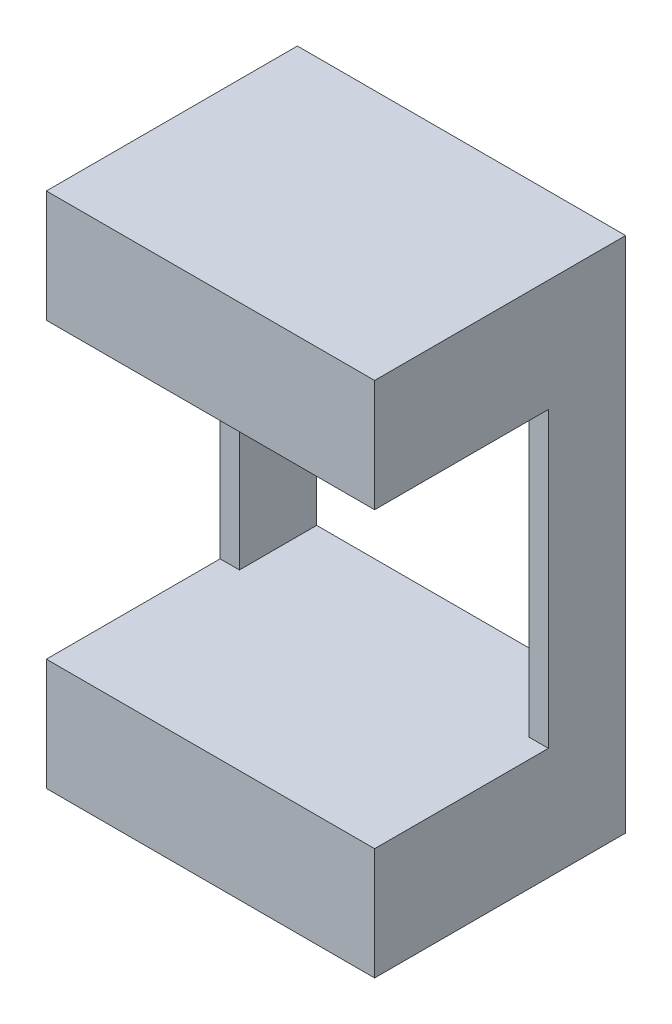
ISO-10303-21;
HEADER;
FILE_DESCRIPTION(('STEP AP214'),'2;1');
FILE_NAME('part.step','',(''),(''),'','','');
FILE_SCHEMA(('AUTOMOTIVE_DESIGN { 1 0 10303 214 1 1 1 1 }'));
ENDSEC;
DATA;
#1=APPLICATION_CONTEXT('core data for automotive mechanical design processes');
#2=APPLICATION_PROTOCOL_DEFINITION('international standard','automotive_design',2000,#1);
#3=PRODUCT_CONTEXT('',#1,'mechanical');
#4=PRODUCT('Part','Part','',(#3));
#5=PRODUCT_RELATED_PRODUCT_CATEGORY('part','',(#4));
#6=PRODUCT_DEFINITION_FORMATION('','',#4);
#7=PRODUCT_DEFINITION_CONTEXT('part definition',#1,'design');
#8=PRODUCT_DEFINITION('design','',#6,#7);
#9=PRODUCT_DEFINITION_SHAPE('','',#8);
#10=(LENGTH_UNIT() NAMED_UNIT(*) SI_UNIT(.MILLI.,.METRE.));
#11=(NAMED_UNIT(*) PLANE_ANGLE_UNIT() SI_UNIT($,.RADIAN.));
#12=(NAMED_UNIT(*) SI_UNIT($,.STERADIAN.) SOLID_ANGLE_UNIT());
#13=UNCERTAINTY_MEASURE_WITH_UNIT(LENGTH_MEASURE(1.E-05),#10,'distance_accuracy_value','');
#14=(GEOMETRIC_REPRESENTATION_CONTEXT(3) GLOBAL_UNCERTAINTY_ASSIGNED_CONTEXT((#13)) GLOBAL_UNIT_ASSIGNED_CONTEXT((#10,
#11,#12)) REPRESENTATION_CONTEXT('',''));
#15=CARTESIAN_POINT('',(0.,0.,0.));
#16=DIRECTION('',(0.,0.,1.));
#17=DIRECTION('',(1.,0.,0.));
#18=AXIS2_PLACEMENT_3D('',#15,#16,#17);
#19=CARTESIAN_POINT('',(0.,0.,9.));
#20=DIRECTION('',(1.,0.,0.));
#21=DIRECTION('',(0.,0.,-1.));
#22=AXIS2_PLACEMENT_3D('',#19,#20,#21);
#23=PLANE('',#22);
#24=DIRECTION('',(0.,1.,0.));
#25=VECTOR('',#24,1.);
#26=CARTESIAN_POINT('',(0.,0.,3.));
#27=LINE('',#26,#25);
#28=CARTESIAN_POINT('',(0.,3.8,3.));
#29=VERTEX_POINT('',#28);
#30=CARTESIAN_POINT('',(0.,15.2,3.));
#31=VERTEX_POINT('',#30);
#32=EDGE_CURVE('E340',#29,#31,#27,.T.);
#33=ORIENTED_EDGE('',*,*,#32,.F.);
#34=DIRECTION('',(0.,0.,1.));
#35=VECTOR('',#34,1.);
#36=CARTESIAN_POINT('',(0.,3.8,-11.2611056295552));
#37=LINE('',#36,#35);
#38=CARTESIAN_POINT('',(0.,3.8,0.));
#39=VERTEX_POINT('',#38);
#40=EDGE_CURVE('E384',#39,#29,#37,.T.);
#41=ORIENTED_EDGE('',*,*,#40,.F.);
#42=DIRECTION('',(0.,-1.,0.));
#43=VECTOR('',#42,1.);
#44=CARTESIAN_POINT('',(0.,0.,0.));
#45=LINE('',#44,#43);
#46=CARTESIAN_POINT('',(0.,15.2,0.));
#47=VERTEX_POINT('',#46);
#48=EDGE_CURVE('E459',#47,#39,#45,.T.);
#49=ORIENTED_EDGE('',*,*,#48,.F.);
#50=DIRECTION('',(0.,0.,1.));
#51=VECTOR('',#50,1.);
#52=CARTESIAN_POINT('',(0.,15.2,-11.2611056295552));
#53=LINE('',#52,#51);
#54=EDGE_CURVE('E429',#47,#31,#53,.T.);
#55=ORIENTED_EDGE('',*,*,#54,.T.);
#56=EDGE_LOOP('',(#33,#41,#49,#55));
#57=FACE_BOUND('',#56,.T.);
#58=ADVANCED_FACE('F85',(#57),#23,.T.);
#59=CARTESIAN_POINT('',(11.25,0.,9.));
#60=DIRECTION('',(-1.,0.,0.));
#61=DIRECTION('',(0.,0.,1.));
#62=AXIS2_PLACEMENT_3D('',#59,#60,#61);
#63=PLANE('',#62);
#64=DIRECTION('',(0.,-1.,0.));
#65=VECTOR('',#64,1.);
#66=CARTESIAN_POINT('',(11.25,0.,3.));
#67=LINE('',#66,#65);
#68=CARTESIAN_POINT('',(11.25,15.2,3.));
#69=VERTEX_POINT('',#68);
#70=CARTESIAN_POINT('',(11.25,3.8,3.));
#71=VERTEX_POINT('',#70);
#72=EDGE_CURVE('E338',#69,#71,#67,.T.);
#73=ORIENTED_EDGE('',*,*,#72,.F.);
#74=DIRECTION('',(0.,0.,1.));
#75=VECTOR('',#74,1.);
#76=CARTESIAN_POINT('',(11.25,15.2,-11.2611056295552));
#77=LINE('',#76,#75);
#78=CARTESIAN_POINT('',(11.25,15.2,0.));
#79=VERTEX_POINT('',#78);
#80=EDGE_CURVE('E436',#79,#69,#77,.T.);
#81=ORIENTED_EDGE('',*,*,#80,.F.);
#82=DIRECTION('',(0.,1.,0.));
#83=VECTOR('',#82,1.);
#84=CARTESIAN_POINT('',(11.25,0.,0.));
#85=LINE('',#84,#83);
#86=CARTESIAN_POINT('',(11.25,3.8,0.));
#87=VERTEX_POINT('',#86);
#88=EDGE_CURVE('E467',#87,#79,#85,.T.);
#89=ORIENTED_EDGE('',*,*,#88,.F.);
#90=DIRECTION('',(0.,0.,1.));
#91=VECTOR('',#90,1.);
#92=CARTESIAN_POINT('',(11.25,3.8,-11.2611056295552));
#93=LINE('',#92,#91);
#94=EDGE_CURVE('E352',#87,#71,#93,.T.);
#95=ORIENTED_EDGE('',*,*,#94,.T.);
#96=EDGE_LOOP('',(#73,#81,#89,#95));
#97=FACE_BOUND('',#96,.T.);
#98=ADVANCED_FACE('F529',(#97),#63,.T.);
#99=DIRECTION('',(0.,-1.,0.));
#100=VECTOR('',#99,1.);
#101=CARTESIAN_POINT('',(0.,0.,9.));
#102=LINE('',#101,#100);
#103=CARTESIAN_POINT('',(0.,19.,9.));
#104=VERTEX_POINT('',#103);
#105=CARTESIAN_POINT('',(0.,15.7,9.));
#106=VERTEX_POINT('',#105);
#107=EDGE_CURVE('E442',#104,#106,#102,.T.);
#108=ORIENTED_EDGE('',*,*,#107,.T.);
#109=DIRECTION('',(0.,0.,1.));
#110=VECTOR('',#109,1.);
#111=CARTESIAN_POINT('',(0.,15.7,-11.2611056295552));
#112=LINE('',#111,#110);
#113=CARTESIAN_POINT('',(0.,15.7,0.));
#114=VERTEX_POINT('',#113);
#115=EDGE_CURVE('E430',#114,#106,#112,.T.);
#116=ORIENTED_EDGE('',*,*,#115,.F.);
#117=CARTESIAN_POINT('',(0.,19.,0.));
#118=VERTEX_POINT('',#117);
#119=EDGE_CURVE('E455',#118,#114,#45,.T.);
#120=ORIENTED_EDGE('',*,*,#119,.F.);
#121=DIRECTION('',(0.,0.,-1.));
#122=VECTOR('',#121,1.);
#123=CARTESIAN_POINT('',(0.,19.,9.));
#124=LINE('',#123,#122);
#125=EDGE_CURVE('E454',#104,#118,#124,.T.);
#126=ORIENTED_EDGE('',*,*,#125,.F.);
#127=EDGE_LOOP('',(#108,#116,#120,#126));
#128=FACE_BOUND('',#127,.T.);
#129=ADVANCED_FACE('F543',(#128),#23,.T.);
#130=CARTESIAN_POINT('',(11.25,15.7,0.));
#131=VERTEX_POINT('',#130);
#132=CARTESIAN_POINT('',(11.25,19.,0.));
#133=VERTEX_POINT('',#132);
#134=EDGE_CURVE('E462',#131,#133,#85,.T.);
#135=ORIENTED_EDGE('',*,*,#134,.F.);
#136=DIRECTION('',(0.,0.,1.));
#137=VECTOR('',#136,1.);
#138=CARTESIAN_POINT('',(11.25,15.7,-11.2611056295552));
#139=LINE('',#138,#137);
#140=CARTESIAN_POINT('',(11.25,15.7,9.));
#141=VERTEX_POINT('',#140);
#142=EDGE_CURVE('E433',#131,#141,#139,.T.);
#143=ORIENTED_EDGE('',*,*,#142,.T.);
#144=DIRECTION('',(0.,1.,0.));
#145=VECTOR('',#144,1.);
#146=CARTESIAN_POINT('',(11.25,0.,9.));
#147=LINE('',#146,#145);
#148=CARTESIAN_POINT('',(11.25,19.,9.));
#149=VERTEX_POINT('',#148);
#150=EDGE_CURVE('E448',#141,#149,#147,.T.);
#151=ORIENTED_EDGE('',*,*,#150,.T.);
#152=DIRECTION('',(0.,0.,-1.));
#153=VECTOR('',#152,1.);
#154=CARTESIAN_POINT('',(11.25,19.,9.));
#155=LINE('',#154,#153);
#156=EDGE_CURVE('E472',#149,#133,#155,.T.);
#157=ORIENTED_EDGE('',*,*,#156,.T.);
#158=EDGE_LOOP('',(#135,#143,#151,#157));
#159=FACE_BOUND('',#158,.T.);
#160=ADVANCED_FACE('F538',(#159),#63,.T.);
#161=CARTESIAN_POINT('',(0.,0.,0.));
#162=DIRECTION('',(0.,0.,1.));
#163=DIRECTION('',(1.,0.,0.));
#164=AXIS2_PLACEMENT_3D('',#161,#162,#163);
#165=PLANE('',#164);
#166=DIRECTION('',(-1.,0.,0.));
#167=VECTOR('',#166,1.);
#168=CARTESIAN_POINT('',(0.,3.3,0.));
#169=LINE('',#168,#167);
#170=CARTESIAN_POINT('',(4.125,3.3,0.));
#171=VERTEX_POINT('',#170);
#172=CARTESIAN_POINT('',(0.,3.3,0.));
#173=VERTEX_POINT('',#172);
#174=EDGE_CURVE('E342',#171,#173,#169,.T.);
#175=ORIENTED_EDGE('',*,*,#174,.T.);
#176=CARTESIAN_POINT('',(0.,0.,0.));
#177=VERTEX_POINT('',#176);
#178=EDGE_CURVE('E108',#173,#177,#45,.T.);
#179=ORIENTED_EDGE('',*,*,#178,.T.);
#180=DIRECTION('',(1.,0.,0.));
#181=VECTOR('',#180,1.);
#182=CARTESIAN_POINT('',(0.,0.,0.));
#183=LINE('',#182,#181);
#184=CARTESIAN_POINT('',(11.25,0.,0.));
#185=VERTEX_POINT('',#184);
#186=EDGE_CURVE('E458',#177,#185,#183,.T.);
#187=ORIENTED_EDGE('',*,*,#186,.T.);
#188=CARTESIAN_POINT('',(11.25,3.3,0.));
#189=VERTEX_POINT('',#188);
#190=EDGE_CURVE('E463',#185,#189,#85,.T.);
#191=ORIENTED_EDGE('',*,*,#190,.T.);
#192=DIRECTION('',(-1.,0.,0.));
#193=VECTOR('',#192,1.);
#194=CARTESIAN_POINT('',(0.,3.3,0.));
#195=LINE('',#194,#193);
#196=CARTESIAN_POINT('',(7.125,3.3,0.));
#197=VERTEX_POINT('',#196);
#198=EDGE_CURVE('E343',#189,#197,#195,.T.);
#199=ORIENTED_EDGE('',*,*,#198,.T.);
#200=DIRECTION('',(0.,1.,0.));
#201=VECTOR('',#200,1.);
#202=CARTESIAN_POINT('',(7.125,0.,0.));
#203=LINE('',#202,#201);
#204=CARTESIAN_POINT('',(7.125,2.8,0.));
#205=VERTEX_POINT('',#204);
#206=EDGE_CURVE('E372',#205,#197,#203,.T.);
#207=ORIENTED_EDGE('',*,*,#206,.F.);
#208=CARTESIAN_POINT('',(5.625,2.8,0.));
#209=DIRECTION('',(0.,0.,1.));
#210=DIRECTION('',(1.,0.,0.));
#211=AXIS2_PLACEMENT_3D('',#208,#209,#210);
#212=CIRCLE('',#211,1.5);
#213=CARTESIAN_POINT('',(4.125,2.8,0.));
#214=VERTEX_POINT('',#213);
#215=EDGE_CURVE('E360',#205,#214,#212,.F.);
#216=ORIENTED_EDGE('',*,*,#215,.T.);
#217=DIRECTION('',(0.,1.,0.));
#218=VECTOR('',#217,1.);
#219=CARTESIAN_POINT('',(4.125,0.,0.));
#220=LINE('',#219,#218);
#221=EDGE_CURVE('E362',#214,#171,#220,.T.);
#222=ORIENTED_EDGE('',*,*,#221,.T.);
#223=EDGE_LOOP('',(#175,#179,#187,#191,#199,#207,#216,#222));
#224=FACE_BOUND('',#223,.T.);
#225=ORIENTED_EDGE('',*,*,#119,.T.);
#226=DIRECTION('',(-1.,0.,0.));
#227=VECTOR('',#226,1.);
#228=CARTESIAN_POINT('',(0.,15.7,0.));
#229=LINE('',#228,#227);
#230=CARTESIAN_POINT('',(4.125,15.7,0.));
#231=VERTEX_POINT('',#230);
#232=EDGE_CURVE('E425',#231,#114,#229,.T.);
#233=ORIENTED_EDGE('',*,*,#232,.F.);
#234=DIRECTION('',(0.,-1.,0.));
#235=VECTOR('',#234,1.);
#236=CARTESIAN_POINT('',(4.125,0.,0.));
#237=LINE('',#236,#235);
#238=CARTESIAN_POINT('',(4.125,16.2,0.));
#239=VERTEX_POINT('',#238);
#240=EDGE_CURVE('E394',#239,#231,#237,.T.);
#241=ORIENTED_EDGE('',*,*,#240,.F.);
#242=CARTESIAN_POINT('',(5.625,16.2,0.));
#243=DIRECTION('',(0.,0.,1.));
#244=DIRECTION('',(1.,0.,0.));
#245=AXIS2_PLACEMENT_3D('',#242,#243,#244);
#246=CIRCLE('',#245,1.5);
#247=CARTESIAN_POINT('',(7.125,16.2,0.));
#248=VERTEX_POINT('',#247);
#249=EDGE_CURVE('E401',#239,#248,#246,.F.);
#250=ORIENTED_EDGE('',*,*,#249,.T.);
#251=DIRECTION('',(0.,-1.,0.));
#252=VECTOR('',#251,1.);
#253=CARTESIAN_POINT('',(7.12500000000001,0.,0.));
#254=LINE('',#253,#252);
#255=CARTESIAN_POINT('',(7.125,15.7,0.));
#256=VERTEX_POINT('',#255);
#257=EDGE_CURVE('E397',#248,#256,#254,.T.);
#258=ORIENTED_EDGE('',*,*,#257,.T.);
#259=EDGE_CURVE('E422',#131,#256,#229,.T.);
#260=ORIENTED_EDGE('',*,*,#259,.F.);
#261=ORIENTED_EDGE('',*,*,#134,.T.);
#262=DIRECTION('',(-1.,0.,0.));
#263=VECTOR('',#262,1.);
#264=CARTESIAN_POINT('',(0.,19.,0.));
#265=LINE('',#264,#263);
#266=EDGE_CURVE('E466',#133,#118,#265,.T.);
#267=ORIENTED_EDGE('',*,*,#266,.T.);
#268=EDGE_LOOP('',(#225,#233,#241,#250,#258,#260,#261,#267));
#269=FACE_BOUND('',#268,.T.);
#270=DIRECTION('',(0.,-1.,0.));
#271=VECTOR('',#270,1.);
#272=CARTESIAN_POINT('',(-0.750000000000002,23.75,0.));
#273=LINE('',#272,#271);
#274=CARTESIAN_POINT('',(-0.750000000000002,19.55,0.));
#275=VERTEX_POINT('',#274);
#276=CARTESIAN_POINT('',(-0.750000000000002,-0.55,0.));
#277=VERTEX_POINT('',#276);
#278=EDGE_CURVE('E93',#275,#277,#273,.T.);
#279=ORIENTED_EDGE('',*,*,#278,.F.);
#280=DIRECTION('',(-1.,0.,0.));
#281=VECTOR('',#280,1.);
#282=CARTESIAN_POINT('',(12.,19.55,0.));
#283=LINE('',#282,#281);
#284=CARTESIAN_POINT('',(12.,19.55,0.));
#285=VERTEX_POINT('',#284);
#286=EDGE_CURVE('E310',#285,#275,#283,.T.);
#287=ORIENTED_EDGE('',*,*,#286,.F.);
#288=DIRECTION('',(0.,1.,0.));
#289=VECTOR('',#288,1.);
#290=CARTESIAN_POINT('',(12.,23.75,0.));
#291=LINE('',#290,#289);
#292=CARTESIAN_POINT('',(12.,-0.55,0.));
#293=VERTEX_POINT('',#292);
#294=EDGE_CURVE('E13',#293,#285,#291,.T.);
#295=ORIENTED_EDGE('',*,*,#294,.F.);
#296=DIRECTION('',(1.,0.,0.));
#297=VECTOR('',#296,1.);
#298=CARTESIAN_POINT('',(12.,-0.55,0.));
#299=LINE('',#298,#297);
#300=EDGE_CURVE('E309',#277,#293,#299,.T.);
#301=ORIENTED_EDGE('',*,*,#300,.F.);
#302=EDGE_LOOP('',(#279,#287,#295,#301));
#303=FACE_BOUND('',#302,.T.);
#304=DIRECTION('',(-1.,0.,0.));
#305=VECTOR('',#304,1.);
#306=CARTESIAN_POINT('',(0.,15.2,0.));
#307=LINE('',#306,#305);
#308=EDGE_CURVE('E405',#79,#47,#307,.T.);
#309=ORIENTED_EDGE('',*,*,#308,.T.);
#310=ORIENTED_EDGE('',*,*,#48,.T.);
#311=DIRECTION('',(-1.,0.,0.));
#312=VECTOR('',#311,1.);
#313=CARTESIAN_POINT('',(0.,3.8,0.));
#314=LINE('',#313,#312);
#315=EDGE_CURVE('E346',#87,#39,#314,.T.);
#316=ORIENTED_EDGE('',*,*,#315,.F.);
#317=ORIENTED_EDGE('',*,*,#88,.T.);
#318=EDGE_LOOP('',(#309,#310,#316,#317));
#319=FACE_BOUND('',#318,.T.);
#320=ADVANCED_FACE('F498',(#224,#269,#303,#319),#165,.F.);
#321=CARTESIAN_POINT('',(-0.750000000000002,23.75,9.));
#322=DIRECTION('',(1.,0.,0.));
#323=DIRECTION('',(0.,0.,-1.));
#324=AXIS2_PLACEMENT_3D('',#321,#322,#323);
#325=PLANE('',#324);
#326=DIRECTION('',(0.,0.,1.));
#327=VECTOR('',#326,1.);
#328=CARTESIAN_POINT('',(-0.750000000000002,19.55,-13.4239524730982));
#329=LINE('',#328,#327);
#330=CARTESIAN_POINT('',(-0.750000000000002,19.55,9.75));
#331=VERTEX_POINT('',#330);
#332=EDGE_CURVE('E313',#275,#331,#329,.T.);
#333=ORIENTED_EDGE('',*,*,#332,.F.);
#334=ORIENTED_EDGE('',*,*,#278,.T.);
#335=DIRECTION('',(0.,0.,1.));
#336=VECTOR('',#335,1.);
#337=CARTESIAN_POINT('',(-0.750000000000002,-0.55,-13.4239524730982));
#338=LINE('',#337,#336);
#339=CARTESIAN_POINT('',(-0.750000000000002,-0.55,9.75));
#340=VERTEX_POINT('',#339);
#341=EDGE_CURVE('E270',#277,#340,#338,.T.);
#342=ORIENTED_EDGE('',*,*,#341,.T.);
#343=DIRECTION('',(0.,-1.,0.));
#344=VECTOR('',#343,1.);
#345=CARTESIAN_POINT('',(-0.750000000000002,3.8,9.75));
#346=LINE('',#345,#344);
#347=CARTESIAN_POINT('',(-0.750000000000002,3.8,9.75));
#348=VERTEX_POINT('',#347);
#349=EDGE_CURVE('E274',#348,#340,#346,.T.);
#350=ORIENTED_EDGE('',*,*,#349,.F.);
#351=DIRECTION('',(0.,0.,1.));
#352=VECTOR('',#351,1.);
#353=CARTESIAN_POINT('',(-0.750000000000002,3.8,3.));
#354=LINE('',#353,#352);
#355=CARTESIAN_POINT('',(-0.750000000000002,3.8,3.));
#356=VERTEX_POINT('',#355);
#357=EDGE_CURVE('E326',#356,#348,#354,.T.);
#358=ORIENTED_EDGE('',*,*,#357,.F.);
#359=DIRECTION('',(0.,-1.,0.));
#360=VECTOR('',#359,1.);
#361=CARTESIAN_POINT('',(-0.750000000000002,15.2,3.));
#362=LINE('',#361,#360);
#363=CARTESIAN_POINT('',(-0.750000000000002,15.2,3.));
#364=VERTEX_POINT('',#363);
#365=EDGE_CURVE('E100',#364,#356,#362,.T.);
#366=ORIENTED_EDGE('',*,*,#365,.F.);
#367=DIRECTION('',(0.,0.,-1.));
#368=VECTOR('',#367,1.);
#369=CARTESIAN_POINT('',(-0.750000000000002,15.2,3.));
#370=LINE('',#369,#368);
#371=CARTESIAN_POINT('',(-0.750000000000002,15.2,9.75));
#372=VERTEX_POINT('',#371);
#373=EDGE_CURVE('E328',#372,#364,#370,.T.);
#374=ORIENTED_EDGE('',*,*,#373,.F.);
#375=DIRECTION('',(0.,-1.,0.));
#376=VECTOR('',#375,1.);
#377=CARTESIAN_POINT('',(-0.750000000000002,19.55,9.75));
#378=LINE('',#377,#376);
#379=EDGE_CURVE('E297',#331,#372,#378,.T.);
#380=ORIENTED_EDGE('',*,*,#379,.F.);
#381=EDGE_LOOP('',(#333,#334,#342,#350,#358,#366,#374,#380));
#382=FACE_BOUND('',#381,.T.);
#383=ADVANCED_FACE('F87',(#382),#325,.F.);
#384=CARTESIAN_POINT('',(12.,23.75,9.));
#385=DIRECTION('',(-1.,0.,0.));
#386=DIRECTION('',(0.,0.,1.));
#387=AXIS2_PLACEMENT_3D('',#384,#385,#386);
#388=PLANE('',#387);
#389=ORIENTED_EDGE('',*,*,#294,.T.);
#390=DIRECTION('',(0.,0.,1.));
#391=VECTOR('',#390,1.);
#392=CARTESIAN_POINT('',(12.,19.55,-13.4239524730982));
#393=LINE('',#392,#391);
#394=CARTESIAN_POINT('',(12.,19.55,9.75));
#395=VERTEX_POINT('',#394);
#396=EDGE_CURVE('E315',#285,#395,#393,.T.);
#397=ORIENTED_EDGE('',*,*,#396,.T.);
#398=DIRECTION('',(0.,1.,0.));
#399=VECTOR('',#398,1.);
#400=CARTESIAN_POINT('',(12.,19.55,9.75));
#401=LINE('',#400,#399);
#402=CARTESIAN_POINT('',(12.,15.2,9.75));
#403=VERTEX_POINT('',#402);
#404=EDGE_CURVE('E303',#403,#395,#401,.T.);
#405=ORIENTED_EDGE('',*,*,#404,.F.);
#406=DIRECTION('',(0.,0.,1.));
#407=VECTOR('',#406,1.);
#408=CARTESIAN_POINT('',(12.,15.2,3.));
#409=LINE('',#408,#407);
#410=CARTESIAN_POINT('',(12.,15.2,3.));
#411=VERTEX_POINT('',#410);
#412=EDGE_CURVE('E319',#411,#403,#409,.T.);
#413=ORIENTED_EDGE('',*,*,#412,.F.);
#414=DIRECTION('',(0.,1.,0.));
#415=VECTOR('',#414,1.);
#416=CARTESIAN_POINT('',(12.,15.2,3.));
#417=LINE('',#416,#415);
#418=CARTESIAN_POINT('',(12.,3.8,3.));
#419=VERTEX_POINT('',#418);
#420=EDGE_CURVE('E321',#419,#411,#417,.T.);
#421=ORIENTED_EDGE('',*,*,#420,.F.);
#422=DIRECTION('',(0.,0.,-1.));
#423=VECTOR('',#422,1.);
#424=CARTESIAN_POINT('',(12.,3.8,3.));
#425=LINE('',#424,#423);
#426=CARTESIAN_POINT('',(12.,3.8,9.75));
#427=VERTEX_POINT('',#426);
#428=EDGE_CURVE('E324',#427,#419,#425,.T.);
#429=ORIENTED_EDGE('',*,*,#428,.F.);
#430=DIRECTION('',(0.,1.,0.));
#431=VECTOR('',#430,1.);
#432=CARTESIAN_POINT('',(12.,3.8,9.75));
#433=LINE('',#432,#431);
#434=CARTESIAN_POINT('',(12.,-0.55,9.75));
#435=VERTEX_POINT('',#434);
#436=EDGE_CURVE('E287',#435,#427,#433,.T.);
#437=ORIENTED_EDGE('',*,*,#436,.F.);
#438=DIRECTION('',(0.,0.,1.));
#439=VECTOR('',#438,1.);
#440=CARTESIAN_POINT('',(12.,-0.55,-13.4239524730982));
#441=LINE('',#440,#439);
#442=EDGE_CURVE('E279',#293,#435,#441,.T.);
#443=ORIENTED_EDGE('',*,*,#442,.F.);
#444=EDGE_LOOP('',(#389,#397,#405,#413,#421,#429,#437,#443));
#445=FACE_BOUND('',#444,.T.);
#446=ADVANCED_FACE('F586',(#445),#388,.F.);
#447=DIRECTION('',(0.,0.,1.));
#448=VECTOR('',#447,1.);
#449=CARTESIAN_POINT('',(0.,3.3,-11.2611056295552));
#450=LINE('',#449,#448);
#451=CARTESIAN_POINT('',(0.,3.3,9.));
#452=VERTEX_POINT('',#451);
#453=EDGE_CURVE('E387',#173,#452,#450,.T.);
#454=ORIENTED_EDGE('',*,*,#453,.T.);
#455=CARTESIAN_POINT('',(0.,0.,9.));
#456=VERTEX_POINT('',#455);
#457=EDGE_CURVE('E446',#452,#456,#102,.T.);
#458=ORIENTED_EDGE('',*,*,#457,.T.);
#459=DIRECTION('',(0.,0.,-1.));
#460=VECTOR('',#459,1.);
#461=CARTESIAN_POINT('',(0.,0.,9.));
#462=LINE('',#461,#460);
#463=EDGE_CURVE('E477',#456,#177,#462,.T.);
#464=ORIENTED_EDGE('',*,*,#463,.T.);
#465=ORIENTED_EDGE('',*,*,#178,.F.);
#466=EDGE_LOOP('',(#454,#458,#464,#465));
#467=FACE_BOUND('',#466,.T.);
#468=ADVANCED_FACE('F479',(#467),#23,.T.);
#469=CARTESIAN_POINT('',(0.,0.,9.));
#470=DIRECTION('',(0.,1.,0.));
#471=DIRECTION('',(0.,0.,1.));
#472=AXIS2_PLACEMENT_3D('',#469,#470,#471);
#473=PLANE('',#472);
#474=ORIENTED_EDGE('',*,*,#186,.F.);
#475=ORIENTED_EDGE('',*,*,#463,.F.);
#476=DIRECTION('',(1.,0.,0.));
#477=VECTOR('',#476,1.);
#478=CARTESIAN_POINT('',(0.,0.,9.));
#479=LINE('',#478,#477);
#480=CARTESIAN_POINT('',(11.25,0.,9.));
#481=VERTEX_POINT('',#480);
#482=EDGE_CURVE('E445',#456,#481,#479,.T.);
#483=ORIENTED_EDGE('',*,*,#482,.T.);
#484=DIRECTION('',(0.,0.,-1.));
#485=VECTOR('',#484,1.);
#486=CARTESIAN_POINT('',(11.25,0.,9.));
#487=LINE('',#486,#485);
#488=EDGE_CURVE('E475',#481,#185,#487,.T.);
#489=ORIENTED_EDGE('',*,*,#488,.T.);
#490=EDGE_LOOP('',(#474,#475,#483,#489));
#491=FACE_BOUND('',#490,.T.);
#492=ADVANCED_FACE('F484',(#491),#473,.T.);
#493=DIRECTION('',(0.,0.,1.));
#494=VECTOR('',#493,1.);
#495=CARTESIAN_POINT('',(11.25,3.3,-11.2611056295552));
#496=LINE('',#495,#494);
#497=CARTESIAN_POINT('',(11.25,3.3,9.));
#498=VERTEX_POINT('',#497);
#499=EDGE_CURVE('E348',#189,#498,#496,.T.);
#500=ORIENTED_EDGE('',*,*,#499,.F.);
#501=ORIENTED_EDGE('',*,*,#190,.F.);
#502=ORIENTED_EDGE('',*,*,#488,.F.);
#503=EDGE_CURVE('E449',#481,#498,#147,.T.);
#504=ORIENTED_EDGE('',*,*,#503,.T.);
#505=EDGE_LOOP('',(#500,#501,#502,#504));
#506=FACE_BOUND('',#505,.T.);
#507=ADVANCED_FACE('F492',(#506),#63,.T.);
#508=CARTESIAN_POINT('',(0.,19.,9.));
#509=DIRECTION('',(0.,-1.,0.));
#510=DIRECTION('',(0.,0.,-1.));
#511=AXIS2_PLACEMENT_3D('',#508,#509,#510);
#512=PLANE('',#511);
#513=ORIENTED_EDGE('',*,*,#266,.F.);
#514=ORIENTED_EDGE('',*,*,#156,.F.);
#515=DIRECTION('',(-1.,0.,0.));
#516=VECTOR('',#515,1.);
#517=CARTESIAN_POINT('',(0.,19.,9.));
#518=LINE('',#517,#516);
#519=EDGE_CURVE('E451',#149,#104,#518,.T.);
#520=ORIENTED_EDGE('',*,*,#519,.T.);
#521=ORIENTED_EDGE('',*,*,#125,.T.);
#522=EDGE_LOOP('',(#513,#514,#520,#521));
#523=FACE_BOUND('',#522,.T.);
#524=ADVANCED_FACE('F540',(#523),#512,.T.);
#525=CARTESIAN_POINT('',(5.625,16.2,-11.2611056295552));
#526=DIRECTION('',(0.,0.,1.));
#527=DIRECTION('',(1.,0.,0.));
#528=AXIS2_PLACEMENT_3D('',#525,#526,#527);
#529=CYLINDRICAL_SURFACE('',#528,1.5);
#530=ORIENTED_EDGE('',*,*,#249,.F.);
#531=DIRECTION('',(0.,0.,1.));
#532=VECTOR('',#531,1.);
#533=CARTESIAN_POINT('',(4.125,16.2,-11.2611056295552));
#534=LINE('',#533,#532);
#535=CARTESIAN_POINT('',(4.125,16.2,9.));
#536=VERTEX_POINT('',#535);
#537=EDGE_CURVE('E416',#239,#536,#534,.T.);
#538=ORIENTED_EDGE('',*,*,#537,.T.);
#539=CARTESIAN_POINT('',(5.625,16.2,9.));
#540=DIRECTION('',(0.,0.,1.));
#541=DIRECTION('',(1.,0.,0.));
#542=AXIS2_PLACEMENT_3D('',#539,#540,#541);
#543=CIRCLE('',#542,1.5);
#544=CARTESIAN_POINT('',(7.125,16.2,9.));
#545=VERTEX_POINT('',#544);
#546=EDGE_CURVE('E404',#545,#536,#543,.T.);
#547=ORIENTED_EDGE('',*,*,#546,.F.);
#548=DIRECTION('',(0.,0.,1.));
#549=VECTOR('',#548,1.);
#550=CARTESIAN_POINT('',(7.125,16.2,-11.2611056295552));
#551=LINE('',#550,#549);
#552=EDGE_CURVE('E410',#248,#545,#551,.T.);
#553=ORIENTED_EDGE('',*,*,#552,.F.);
#554=EDGE_LOOP('',(#530,#538,#547,#553));
#555=FACE_BOUND('',#554,.T.);
#556=ADVANCED_FACE('F554',(#555),#529,.T.);
#557=CARTESIAN_POINT('',(4.125,0.,-11.2611056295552));
#558=DIRECTION('',(1.,0.,0.));
#559=DIRECTION('',(0.,0.,-1.));
#560=AXIS2_PLACEMENT_3D('',#557,#558,#559);
#561=PLANE('',#560);
#562=ORIENTED_EDGE('',*,*,#537,.F.);
#563=ORIENTED_EDGE('',*,*,#240,.T.);
#564=DIRECTION('',(0.,0.,1.));
#565=VECTOR('',#564,1.);
#566=CARTESIAN_POINT('',(4.125,15.7,-11.2611056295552));
#567=LINE('',#566,#565);
#568=CARTESIAN_POINT('',(4.125,15.7,9.));
#569=VERTEX_POINT('',#568);
#570=EDGE_CURVE('E413',#231,#569,#567,.T.);
#571=ORIENTED_EDGE('',*,*,#570,.T.);
#572=DIRECTION('',(0.,1.,0.));
#573=VECTOR('',#572,1.);
#574=CARTESIAN_POINT('',(4.125,0.,9.));
#575=LINE('',#574,#573);
#576=EDGE_CURVE('E407',#569,#536,#575,.T.);
#577=ORIENTED_EDGE('',*,*,#576,.T.);
#578=EDGE_LOOP('',(#562,#563,#571,#577));
#579=FACE_BOUND('',#578,.T.);
#580=ADVANCED_FACE('F549',(#579),#561,.F.);
#581=CARTESIAN_POINT('',(7.12500000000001,0.,-11.2611056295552));
#582=DIRECTION('',(1.,0.,0.));
#583=DIRECTION('',(0.,1.,0.));
#584=AXIS2_PLACEMENT_3D('',#581,#582,#583);
#585=PLANE('',#584);
#586=ORIENTED_EDGE('',*,*,#257,.F.);
#587=ORIENTED_EDGE('',*,*,#552,.T.);
#588=DIRECTION('',(0.,1.,0.));
#589=VECTOR('',#588,1.);
#590=CARTESIAN_POINT('',(7.12500000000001,0.,9.));
#591=LINE('',#590,#589);
#592=CARTESIAN_POINT('',(7.125,15.7,9.));
#593=VERTEX_POINT('',#592);
#594=EDGE_CURVE('E402',#593,#545,#591,.T.);
#595=ORIENTED_EDGE('',*,*,#594,.F.);
#596=DIRECTION('',(0.,0.,1.));
#597=VECTOR('',#596,1.);
#598=CARTESIAN_POINT('',(7.125,15.7,-11.2611056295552));
#599=LINE('',#598,#597);
#600=EDGE_CURVE('E398',#256,#593,#599,.T.);
#601=ORIENTED_EDGE('',*,*,#600,.F.);
#602=EDGE_LOOP('',(#586,#587,#595,#601));
#603=FACE_BOUND('',#602,.T.);
#604=ADVANCED_FACE('F557',(#603),#585,.T.);
#605=CARTESIAN_POINT('',(0.,15.2,-11.2611056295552));
#606=DIRECTION('',(0.,-1.,0.));
#607=DIRECTION('',(1.,0.,0.));
#608=AXIS2_PLACEMENT_3D('',#605,#606,#607);
#609=PLANE('',#608);
#610=ORIENTED_EDGE('',*,*,#80,.T.);
#611=DIRECTION('',(-1.,0.,0.));
#612=VECTOR('',#611,1.);
#613=CARTESIAN_POINT('',(24.8825463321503,15.2,3.));
#614=LINE('',#613,#612);
#615=EDGE_CURVE('E322',#411,#69,#614,.T.);
#616=ORIENTED_EDGE('',*,*,#615,.F.);
#617=ORIENTED_EDGE('',*,*,#412,.T.);
#618=DIRECTION('',(1.,0.,0.));
#619=VECTOR('',#618,1.);
#620=CARTESIAN_POINT('',(-0.750000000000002,15.2,9.75));
#621=LINE('',#620,#619);
#622=EDGE_CURVE('E300',#372,#403,#621,.T.);
#623=ORIENTED_EDGE('',*,*,#622,.F.);
#624=ORIENTED_EDGE('',*,*,#373,.T.);
#625=EDGE_CURVE('E333',#31,#364,#614,.T.);
#626=ORIENTED_EDGE('',*,*,#625,.F.);
#627=ORIENTED_EDGE('',*,*,#54,.F.);
#628=ORIENTED_EDGE('',*,*,#308,.F.);
#629=EDGE_LOOP('',(#610,#616,#617,#623,#624,#626,#627,#628));
#630=FACE_BOUND('',#629,.T.);
#631=ADVANCED_FACE('F566',(#630),#609,.T.);
#632=CARTESIAN_POINT('',(0.,15.7,-11.2611056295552));
#633=DIRECTION('',(0.,-1.,0.));
#634=DIRECTION('',(0.,0.,-1.));
#635=AXIS2_PLACEMENT_3D('',#632,#633,#634);
#636=PLANE('',#635);
#637=ORIENTED_EDGE('',*,*,#570,.F.);
#638=ORIENTED_EDGE('',*,*,#232,.T.);
#639=ORIENTED_EDGE('',*,*,#115,.T.);
#640=DIRECTION('',(1.,0.,0.));
#641=VECTOR('',#640,1.);
#642=CARTESIAN_POINT('',(0.,15.7,9.));
#643=LINE('',#642,#641);
#644=EDGE_CURVE('E426',#106,#569,#643,.T.);
#645=ORIENTED_EDGE('',*,*,#644,.T.);
#646=EDGE_LOOP('',(#637,#638,#639,#645));
#647=FACE_BOUND('',#646,.T.);
#648=ADVANCED_FACE('F564',(#647),#636,.F.);
#649=ORIENTED_EDGE('',*,*,#259,.T.);
#650=ORIENTED_EDGE('',*,*,#600,.T.);
#651=EDGE_CURVE('E357',#593,#141,#643,.T.);
#652=ORIENTED_EDGE('',*,*,#651,.T.);
#653=ORIENTED_EDGE('',*,*,#142,.F.);
#654=EDGE_LOOP('',(#649,#650,#652,#653));
#655=FACE_BOUND('',#654,.T.);
#656=ADVANCED_FACE('F561',(#655),#636,.F.);
#657=CARTESIAN_POINT('',(0.,3.3,-11.2611056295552));
#658=DIRECTION('',(0.,-1.,0.));
#659=DIRECTION('',(1.,0.,0.));
#660=AXIS2_PLACEMENT_3D('',#657,#658,#659);
#661=PLANE('',#660);
#662=ORIENTED_EDGE('',*,*,#174,.F.);
#663=DIRECTION('',(0.,0.,1.));
#664=VECTOR('',#663,1.);
#665=CARTESIAN_POINT('',(4.125,3.3,-11.2611056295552));
#666=LINE('',#665,#664);
#667=CARTESIAN_POINT('',(4.125,3.3,9.));
#668=VERTEX_POINT('',#667);
#669=EDGE_CURVE('E389',#171,#668,#666,.T.);
#670=ORIENTED_EDGE('',*,*,#669,.T.);
#671=DIRECTION('',(1.,0.,0.));
#672=VECTOR('',#671,1.);
#673=CARTESIAN_POINT('',(0.,3.3,9.));
#674=LINE('',#673,#672);
#675=EDGE_CURVE('E363',#452,#668,#674,.T.);
#676=ORIENTED_EDGE('',*,*,#675,.F.);
#677=ORIENTED_EDGE('',*,*,#453,.F.);
#678=EDGE_LOOP('',(#662,#670,#676,#677));
#679=FACE_BOUND('',#678,.T.);
#680=ADVANCED_FACE('F514',(#679),#661,.T.);
#681=CARTESIAN_POINT('',(0.,3.8,-11.2611056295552));
#682=DIRECTION('',(0.,-1.,0.));
#683=DIRECTION('',(1.,0.,0.));
#684=AXIS2_PLACEMENT_3D('',#681,#682,#683);
#685=PLANE('',#684);
#686=ORIENTED_EDGE('',*,*,#40,.T.);
#687=DIRECTION('',(-1.,0.,0.));
#688=VECTOR('',#687,1.);
#689=CARTESIAN_POINT('',(24.8825463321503,3.8,3.));
#690=LINE('',#689,#688);
#691=EDGE_CURVE('E331',#29,#356,#690,.T.);
#692=ORIENTED_EDGE('',*,*,#691,.T.);
#693=ORIENTED_EDGE('',*,*,#357,.T.);
#694=DIRECTION('',(-1.,0.,0.));
#695=VECTOR('',#694,1.);
#696=CARTESIAN_POINT('',(-0.750000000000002,3.8,9.75));
#697=LINE('',#696,#695);
#698=EDGE_CURVE('E292',#427,#348,#697,.T.);
#699=ORIENTED_EDGE('',*,*,#698,.F.);
#700=ORIENTED_EDGE('',*,*,#428,.T.);
#701=EDGE_CURVE('E334',#419,#71,#690,.T.);
#702=ORIENTED_EDGE('',*,*,#701,.T.);
#703=ORIENTED_EDGE('',*,*,#94,.F.);
#704=ORIENTED_EDGE('',*,*,#315,.T.);
#705=EDGE_LOOP('',(#686,#692,#693,#699,#700,#702,#703,#704));
#706=FACE_BOUND('',#705,.T.);
#707=ADVANCED_FACE('F525',(#706),#685,.F.);
#708=CARTESIAN_POINT('',(7.125,0.,-11.2611056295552));
#709=DIRECTION('',(-1.,0.,0.));
#710=DIRECTION('',(0.,0.,1.));
#711=AXIS2_PLACEMENT_3D('',#708,#709,#710);
#712=PLANE('',#711);
#713=DIRECTION('',(0.,0.,1.));
#714=VECTOR('',#713,1.);
#715=CARTESIAN_POINT('',(7.125,2.8,-11.2611056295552));
#716=LINE('',#715,#714);
#717=CARTESIAN_POINT('',(7.125,2.8,9.));
#718=VERTEX_POINT('',#717);
#719=EDGE_CURVE('E368',#205,#718,#716,.T.);
#720=ORIENTED_EDGE('',*,*,#719,.F.);
#721=ORIENTED_EDGE('',*,*,#206,.T.);
#722=DIRECTION('',(0.,0.,1.));
#723=VECTOR('',#722,1.);
#724=CARTESIAN_POINT('',(7.125,3.3,-11.2611056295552));
#725=LINE('',#724,#723);
#726=CARTESIAN_POINT('',(7.125,3.3,9.));
#727=VERTEX_POINT('',#726);
#728=EDGE_CURVE('E370',#197,#727,#725,.T.);
#729=ORIENTED_EDGE('',*,*,#728,.T.);
#730=DIRECTION('',(0.,-1.,0.));
#731=VECTOR('',#730,1.);
#732=CARTESIAN_POINT('',(7.125,0.,9.));
#733=LINE('',#732,#731);
#734=EDGE_CURVE('E367',#727,#718,#733,.T.);
#735=ORIENTED_EDGE('',*,*,#734,.T.);
#736=EDGE_LOOP('',(#720,#721,#729,#735));
#737=FACE_BOUND('',#736,.T.);
#738=ADVANCED_FACE('F502',(#737),#712,.F.);
#739=CARTESIAN_POINT('',(5.625,2.8,-11.2611056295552));
#740=DIRECTION('',(0.,0.,1.));
#741=DIRECTION('',(1.,0.,0.));
#742=AXIS2_PLACEMENT_3D('',#739,#740,#741);
#743=CYLINDRICAL_SURFACE('',#742,1.5);
#744=ORIENTED_EDGE('',*,*,#215,.F.);
#745=ORIENTED_EDGE('',*,*,#719,.T.);
#746=CARTESIAN_POINT('',(5.625,2.8,9.));
#747=DIRECTION('',(0.,0.,1.));
#748=DIRECTION('',(1.,0.,0.));
#749=AXIS2_PLACEMENT_3D('',#746,#747,#748);
#750=CIRCLE('',#749,1.5);
#751=CARTESIAN_POINT('',(4.125,2.8,9.));
#752=VERTEX_POINT('',#751);
#753=EDGE_CURVE('E375',#752,#718,#750,.T.);
#754=ORIENTED_EDGE('',*,*,#753,.F.);
#755=DIRECTION('',(0.,0.,1.));
#756=VECTOR('',#755,1.);
#757=CARTESIAN_POINT('',(4.125,2.8,-11.2611056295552));
#758=LINE('',#757,#756);
#759=EDGE_CURVE('E364',#214,#752,#758,.T.);
#760=ORIENTED_EDGE('',*,*,#759,.F.);
#761=EDGE_LOOP('',(#744,#745,#754,#760));
#762=FACE_BOUND('',#761,.T.);
#763=ADVANCED_FACE('F506',(#762),#743,.T.);
#764=CARTESIAN_POINT('',(0.,3.3,-11.2611056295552));
#765=DIRECTION('',(0.,-1.,0.));
#766=DIRECTION('',(1.,0.,0.));
#767=AXIS2_PLACEMENT_3D('',#764,#765,#766);
#768=PLANE('',#767);
#769=ORIENTED_EDGE('',*,*,#728,.F.);
#770=ORIENTED_EDGE('',*,*,#198,.F.);
#771=ORIENTED_EDGE('',*,*,#499,.T.);
#772=DIRECTION('',(1.,0.,0.));
#773=VECTOR('',#772,1.);
#774=CARTESIAN_POINT('',(0.,3.3,9.));
#775=LINE('',#774,#773);
#776=EDGE_CURVE('E351',#727,#498,#775,.T.);
#777=ORIENTED_EDGE('',*,*,#776,.F.);
#778=EDGE_LOOP('',(#769,#770,#771,#777));
#779=FACE_BOUND('',#778,.T.);
#780=ADVANCED_FACE('F496',(#779),#768,.T.);
#781=CARTESIAN_POINT('',(4.125,0.,-11.2611056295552));
#782=DIRECTION('',(-1.,0.,0.));
#783=DIRECTION('',(0.,0.,1.));
#784=AXIS2_PLACEMENT_3D('',#781,#782,#783);
#785=PLANE('',#784);
#786=ORIENTED_EDGE('',*,*,#221,.F.);
#787=ORIENTED_EDGE('',*,*,#759,.T.);
#788=DIRECTION('',(0.,-1.,0.));
#789=VECTOR('',#788,1.);
#790=CARTESIAN_POINT('',(4.125,0.,9.));
#791=LINE('',#790,#789);
#792=EDGE_CURVE('E347',#668,#752,#791,.T.);
#793=ORIENTED_EDGE('',*,*,#792,.F.);
#794=ORIENTED_EDGE('',*,*,#669,.F.);
#795=EDGE_LOOP('',(#786,#787,#793,#794));
#796=FACE_BOUND('',#795,.T.);
#797=ADVANCED_FACE('F510',(#796),#785,.T.);
#798=CARTESIAN_POINT('',(24.8825463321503,15.2,3.));
#799=DIRECTION('',(0.,0.,-1.));
#800=DIRECTION('',(0.,1.,0.));
#801=AXIS2_PLACEMENT_3D('',#798,#799,#800);
#802=PLANE('',#801);
#803=ORIENTED_EDGE('',*,*,#72,.T.);
#804=ORIENTED_EDGE('',*,*,#701,.F.);
#805=ORIENTED_EDGE('',*,*,#420,.T.);
#806=ORIENTED_EDGE('',*,*,#615,.T.);
#807=EDGE_LOOP('',(#803,#804,#805,#806));
#808=FACE_BOUND('',#807,.T.);
#809=ADVANCED_FACE('F690',(#808),#802,.F.);
#810=ORIENTED_EDGE('',*,*,#32,.T.);
#811=ORIENTED_EDGE('',*,*,#625,.T.);
#812=ORIENTED_EDGE('',*,*,#365,.T.);
#813=ORIENTED_EDGE('',*,*,#691,.F.);
#814=EDGE_LOOP('',(#810,#811,#812,#813));
#815=FACE_BOUND('',#814,.T.);
#816=ADVANCED_FACE('F700',(#815),#802,.F.);
#817=CARTESIAN_POINT('',(-0.750000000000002,-0.55,-13.4239524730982));
#818=DIRECTION('',(0.,1.,0.));
#819=DIRECTION('',(0.,0.,1.));
#820=AXIS2_PLACEMENT_3D('',#817,#818,#819);
#821=PLANE('',#820);
#822=ORIENTED_EDGE('',*,*,#341,.F.);
#823=ORIENTED_EDGE('',*,*,#300,.T.);
#824=ORIENTED_EDGE('',*,*,#442,.T.);
#825=DIRECTION('',(1.,0.,0.));
#826=VECTOR('',#825,1.);
#827=CARTESIAN_POINT('',(-0.750000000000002,-0.55,9.75));
#828=LINE('',#827,#826);
#829=EDGE_CURVE('E282',#340,#435,#828,.T.);
#830=ORIENTED_EDGE('',*,*,#829,.F.);
#831=EDGE_LOOP('',(#822,#823,#824,#830));
#832=FACE_BOUND('',#831,.T.);
#833=ADVANCED_FACE('F283',(#832),#821,.F.);
#834=CARTESIAN_POINT('',(-0.750000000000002,19.55,-13.4239524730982));
#835=DIRECTION('',(0.,-1.,0.));
#836=DIRECTION('',(0.,0.,-1.));
#837=AXIS2_PLACEMENT_3D('',#834,#835,#836);
#838=PLANE('',#837);
#839=ORIENTED_EDGE('',*,*,#396,.F.);
#840=ORIENTED_EDGE('',*,*,#286,.T.);
#841=ORIENTED_EDGE('',*,*,#332,.T.);
#842=DIRECTION('',(-1.,0.,0.));
#843=VECTOR('',#842,1.);
#844=CARTESIAN_POINT('',(-0.750000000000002,19.55,9.75));
#845=LINE('',#844,#843);
#846=EDGE_CURVE('E306',#395,#331,#845,.T.);
#847=ORIENTED_EDGE('',*,*,#846,.F.);
#848=EDGE_LOOP('',(#839,#840,#841,#847));
#849=FACE_BOUND('',#848,.T.);
#850=ADVANCED_FACE('F699',(#849),#838,.F.);
#851=CARTESIAN_POINT('',(0.,0.,9.75));
#852=DIRECTION('',(0.,0.,1.));
#853=DIRECTION('',(1.,0.,0.));
#854=AXIS2_PLACEMENT_3D('',#851,#852,#853);
#855=PLANE('',#854);
#856=ORIENTED_EDGE('',*,*,#379,.T.);
#857=ORIENTED_EDGE('',*,*,#622,.T.);
#858=ORIENTED_EDGE('',*,*,#404,.T.);
#859=ORIENTED_EDGE('',*,*,#846,.T.);
#860=EDGE_LOOP('',(#856,#857,#858,#859));
#861=FACE_BOUND('',#860,.T.);
#862=ADVANCED_FACE('F711',(#861),#855,.T.);
#863=CARTESIAN_POINT('',(0.,0.,9.));
#864=DIRECTION('',(0.,0.,1.));
#865=DIRECTION('',(1.,0.,0.));
#866=AXIS2_PLACEMENT_3D('',#863,#864,#865);
#867=PLANE('',#866);
#868=ORIENTED_EDGE('',*,*,#576,.F.);
#869=ORIENTED_EDGE('',*,*,#644,.F.);
#870=ORIENTED_EDGE('',*,*,#107,.F.);
#871=ORIENTED_EDGE('',*,*,#519,.F.);
#872=ORIENTED_EDGE('',*,*,#150,.F.);
#873=ORIENTED_EDGE('',*,*,#651,.F.);
#874=ORIENTED_EDGE('',*,*,#594,.T.);
#875=ORIENTED_EDGE('',*,*,#546,.T.);
#876=EDGE_LOOP('',(#868,#869,#870,#871,#872,#873,#874,#875));
#877=FACE_BOUND('',#876,.T.);
#878=ADVANCED_FACE('F563',(#877),#867,.F.);
#879=CARTESIAN_POINT('',(0.,0.,9.75));
#880=DIRECTION('',(0.,0.,1.));
#881=DIRECTION('',(1.,0.,0.));
#882=AXIS2_PLACEMENT_3D('',#879,#880,#881);
#883=PLANE('',#882);
#884=ORIENTED_EDGE('',*,*,#349,.T.);
#885=ORIENTED_EDGE('',*,*,#829,.T.);
#886=ORIENTED_EDGE('',*,*,#436,.T.);
#887=ORIENTED_EDGE('',*,*,#698,.T.);
#888=EDGE_LOOP('',(#884,#885,#886,#887));
#889=FACE_BOUND('',#888,.T.);
#890=ADVANCED_FACE('F290',(#889),#883,.T.);
#891=CARTESIAN_POINT('',(0.,0.,9.));
#892=DIRECTION('',(0.,0.,1.));
#893=DIRECTION('',(1.,0.,0.));
#894=AXIS2_PLACEMENT_3D('',#891,#892,#893);
#895=PLANE('',#894);
#896=ORIENTED_EDGE('',*,*,#482,.F.);
#897=ORIENTED_EDGE('',*,*,#457,.F.);
#898=ORIENTED_EDGE('',*,*,#675,.T.);
#899=ORIENTED_EDGE('',*,*,#792,.T.);
#900=ORIENTED_EDGE('',*,*,#753,.T.);
#901=ORIENTED_EDGE('',*,*,#734,.F.);
#902=ORIENTED_EDGE('',*,*,#776,.T.);
#903=ORIENTED_EDGE('',*,*,#503,.F.);
#904=EDGE_LOOP('',(#896,#897,#898,#899,#900,#901,#902,#903));
#905=FACE_BOUND('',#904,.T.);
#906=ADVANCED_FACE('F488',(#905),#895,.F.);
#907=CLOSED_SHELL('',(#58,#98,#129,#160,#320,#383,#446,#468,#492,#507,#524,#556,#580,#604,#631,
#648,#656,#680,#707,#738,#763,#780,#797,#809,#816,#833,#850,#862,#878,#890,#906));
#908=MANIFOLD_SOLID_BREP('B2',#907);
#909=ADVANCED_BREP_SHAPE_REPRESENTATION('',(#18,#908),#14);
#910=SHAPE_DEFINITION_REPRESENTATION(#9,#909);
ENDSEC;
END-ISO-10303-21;
